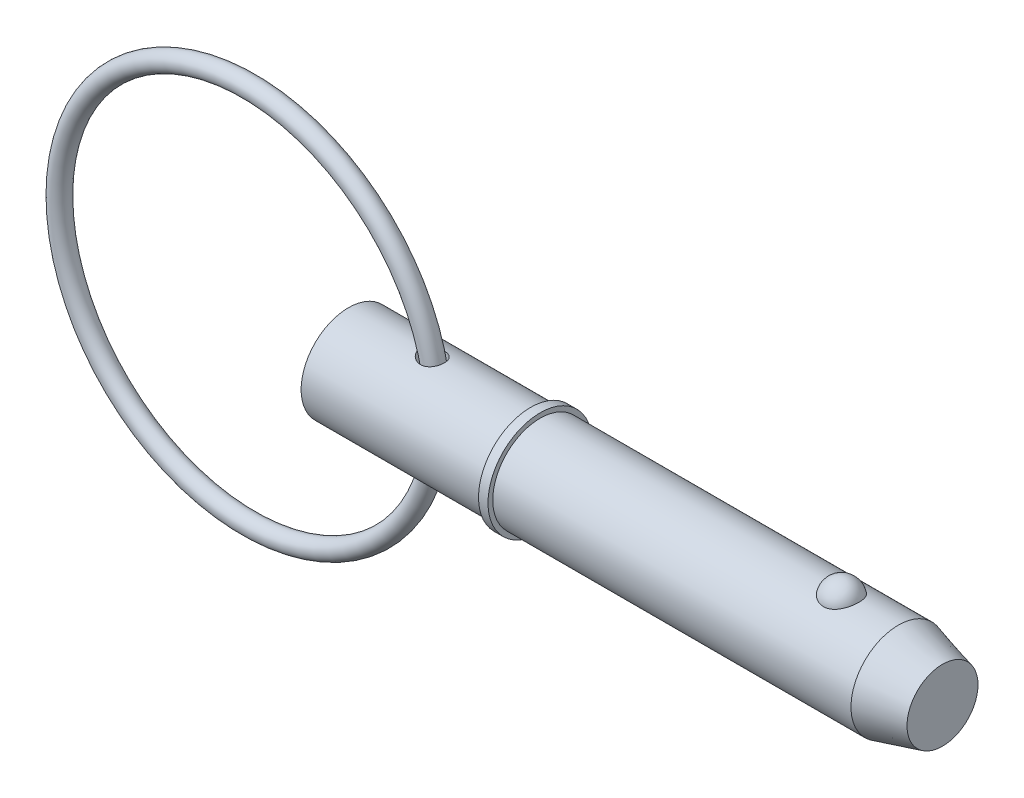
ISO-10303-21;
HEADER;
FILE_DESCRIPTION(('STEP AP214'),'2;1');
FILE_NAME('part.step','',(''),(''),'','','');
FILE_SCHEMA(('AUTOMOTIVE_DESIGN { 1 0 10303 214 1 1 1 1 }'));
ENDSEC;
DATA;
#1=APPLICATION_CONTEXT('core data for automotive mechanical design processes');
#2=APPLICATION_PROTOCOL_DEFINITION('international standard','automotive_design',2000,#1);
#3=PRODUCT_CONTEXT('',#1,'mechanical');
#4=PRODUCT('Part','Part','',(#3));
#5=PRODUCT_RELATED_PRODUCT_CATEGORY('part','',(#4));
#6=PRODUCT_DEFINITION_FORMATION('','',#4);
#7=PRODUCT_DEFINITION_CONTEXT('part definition',#1,'design');
#8=PRODUCT_DEFINITION('design','',#6,#7);
#9=PRODUCT_DEFINITION_SHAPE('','',#8);
#10=(LENGTH_UNIT() NAMED_UNIT(*) SI_UNIT(.MILLI.,.METRE.));
#11=(NAMED_UNIT(*) PLANE_ANGLE_UNIT() SI_UNIT($,.RADIAN.));
#12=(NAMED_UNIT(*) SI_UNIT($,.STERADIAN.) SOLID_ANGLE_UNIT());
#13=UNCERTAINTY_MEASURE_WITH_UNIT(LENGTH_MEASURE(1.E-05),#10,'distance_accuracy_value','');
#14=(GEOMETRIC_REPRESENTATION_CONTEXT(3) GLOBAL_UNCERTAINTY_ASSIGNED_CONTEXT((#13)) GLOBAL_UNIT_ASSIGNED_CONTEXT((#10,
#11,#12)) REPRESENTATION_CONTEXT('',''));
#15=CARTESIAN_POINT('',(0.,0.,0.));
#16=DIRECTION('',(0.,0.,1.));
#17=DIRECTION('',(1.,0.,0.));
#18=AXIS2_PLACEMENT_3D('',#15,#16,#17);
#19=CARTESIAN_POINT('',(-13.3798047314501,0.,0.));
#20=DIRECTION('',(0.,0.,1.));
#21=DIRECTION('',(1.,0.,0.));
#22=AXIS2_PLACEMENT_3D('',#19,#20,#21);
#23=TOROIDAL_SURFACE('',#22,25.4,1.27);
#24=CARTESIAN_POINT('',(13.2901952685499,0.,0.));
#25=VERTEX_POINT('',#24);
#26=VERTEX_LOOP('',#25);
#27=FACE_BOUND('',#26,.T.);
#28=ADVANCED_FACE('P0_F12',(#27),#23,.T.);
#29=CLOSED_SHELL('',(#28));
#30=MANIFOLD_SOLID_BREP('P0_B1',#29);
#31=CARTESIAN_POINT('',(0.,0.,0.));
#32=DIRECTION('',(1.,0.,0.));
#33=DIRECTION('',(0.,0.,-1.));
#34=AXIS2_PLACEMENT_3D('',#31,#32,#33);
#35=CYLINDRICAL_SURFACE('',#34,6.35);
#36=CARTESIAN_POINT('',(9.67500140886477,6.32698634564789,-0.540133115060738));
#37=CARTESIAN_POINT('',(9.70878953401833,6.3197498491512,-0.624879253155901));
#38=CARTESIAN_POINT('',(9.75028044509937,6.31105328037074,-0.706504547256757));
#39=CARTESIAN_POINT('',(9.84659255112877,6.29180070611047,-0.861319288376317));
#40=CARTESIAN_POINT('',(9.90144039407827,6.28124099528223,-0.934491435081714));
#41=CARTESIAN_POINT('',(10.021999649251,6.25949497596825,-1.0704877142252));
#42=CARTESIAN_POINT('',(10.0876589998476,6.2483118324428,-1.1333586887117));
#43=CARTESIAN_POINT('',(10.2280180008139,6.22641783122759,-1.24805262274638));
#44=CARTESIAN_POINT('',(10.3027159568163,6.21570688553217,-1.29987764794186));
#45=CARTESIAN_POINT('',(10.4650889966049,6.19509606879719,-1.39492899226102));
#46=CARTESIAN_POINT('',(10.5533142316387,6.1853135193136,-1.4372443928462));
#47=CARTESIAN_POINT('',(10.7357818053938,6.16871128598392,-1.50691441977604));
#48=CARTESIAN_POINT('',(10.8300253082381,6.16189217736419,-1.53426614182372));
#49=CARTESIAN_POINT('',(11.0227953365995,6.15211299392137,-1.57302798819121));
#50=CARTESIAN_POINT('',(11.1213511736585,6.14918579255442,-1.58430237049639));
#51=CARTESIAN_POINT('',(11.3189518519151,6.1478413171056,-1.58951619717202));
#52=CARTESIAN_POINT('',(11.417996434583,6.14942187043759,-1.58346399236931));
#53=CARTESIAN_POINT('',(11.6070859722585,6.15678569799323,-1.55457003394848));
#54=CARTESIAN_POINT('',(11.6973059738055,6.16229943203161,-1.53280404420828));
#55=CARTESIAN_POINT('',(11.8723373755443,6.176630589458,-1.4739892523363));
#56=CARTESIAN_POINT('',(11.9571502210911,6.185447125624,-1.43694455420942));
#57=CARTESIAN_POINT('',(12.1146737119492,6.20482821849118,-1.3507217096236));
#58=CARTESIAN_POINT('',(12.1877743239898,6.21528554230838,-1.30222952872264));
#59=CARTESIAN_POINT('',(12.324618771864,6.23705116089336,-1.19362916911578));
#60=CARTESIAN_POINT('',(12.3883628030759,6.24835943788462,-1.1335212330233));
#61=CARTESIAN_POINT('',(12.5046662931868,6.27053957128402,-1.00357204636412));
#62=CARTESIAN_POINT('',(12.5572571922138,6.28141258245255,-0.933759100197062));
#63=CARTESIAN_POINT('',(12.6502125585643,6.30157953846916,-0.786214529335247));
#64=CARTESIAN_POINT('',(12.6905764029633,6.31087340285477,-0.708482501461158));
#65=CARTESIAN_POINT('',(12.7585531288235,6.32699259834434,-0.546246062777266));
#66=CARTESIAN_POINT('',(12.7860022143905,6.33378599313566,-0.461669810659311));
#67=CARTESIAN_POINT('',(12.8267605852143,6.34401050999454,-0.288980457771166));
#68=CARTESIAN_POINT('',(12.8400695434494,6.34744155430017,-0.200867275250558));
#69=CARTESIAN_POINT('',(12.8522644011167,6.35058177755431,-0.0231943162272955));
#70=CARTESIAN_POINT('',(12.8510870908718,6.35027464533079,0.0663700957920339));
#71=CARTESIAN_POINT('',(12.8341831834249,6.34593169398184,0.244024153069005));
#72=CARTESIAN_POINT('',(12.8184563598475,6.341895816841,0.332113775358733));
#73=CARTESIAN_POINT('',(12.7728208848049,6.33052992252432,0.504322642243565));
#74=CARTESIAN_POINT('',(12.7429114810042,6.32319973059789,0.588441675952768));
#75=CARTESIAN_POINT('',(12.6696162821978,6.30604116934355,0.750316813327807));
#76=CARTESIAN_POINT('',(12.6262302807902,6.29621276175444,0.828072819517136));
#77=CARTESIAN_POINT('',(12.5270856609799,6.27515240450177,0.974918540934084));
#78=CARTESIAN_POINT('',(12.4713403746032,6.26392197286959,1.04401746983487));
#79=CARTESIAN_POINT('',(12.3488662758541,6.24131002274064,1.1716478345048));
#80=CARTESIAN_POINT('',(12.2821384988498,6.22992851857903,1.23018026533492));
#81=CARTESIAN_POINT('',(12.1401870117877,6.20841765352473,1.33449214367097));
#82=CARTESIAN_POINT('',(12.0650507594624,6.19827734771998,1.38038832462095));
#83=CARTESIAN_POINT('',(11.9079044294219,6.18026478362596,1.45892404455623));
#84=CARTESIAN_POINT('',(11.8258951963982,6.17239224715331,1.49156520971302));
#85=CARTESIAN_POINT('',(11.6581736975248,6.15982613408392,1.54263810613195));
#86=CARTESIAN_POINT('',(11.572502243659,6.15510409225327,1.56119728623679));
#87=CARTESIAN_POINT('',(11.3991899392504,6.14916283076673,1.58443707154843));
#88=CARTESIAN_POINT('',(11.3115488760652,6.14794399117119,1.58911617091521));
#89=CARTESIAN_POINT('',(11.1345547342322,6.14904466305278,1.58485137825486));
#90=CARTESIAN_POINT('',(11.0452104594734,6.15144894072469,1.5755811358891));
#91=CARTESIAN_POINT('',(10.8691479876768,6.15957601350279,1.54349959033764));
#92=CARTESIAN_POINT('',(10.782430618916,6.16529984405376,1.52068406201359));
#93=CARTESIAN_POINT('',(10.6082848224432,6.17983892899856,1.4605156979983));
#94=CARTESIAN_POINT('',(10.5211557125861,6.1888262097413,1.42233764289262));
#95=CARTESIAN_POINT('',(10.3542377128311,6.20874782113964,1.33268652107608));
#96=CARTESIAN_POINT('',(10.2744521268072,6.21968302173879,1.28120750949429));
#97=CARTESIAN_POINT('',(10.120854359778,6.24282707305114,1.16334748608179));
#98=CARTESIAN_POINT('',(10.0474902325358,6.25507146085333,1.09638652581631));
#99=CARTESIAN_POINT('',(9.91368693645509,6.27890019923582,0.950453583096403));
#100=CARTESIAN_POINT('',(9.85324511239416,6.29048468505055,0.87148407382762));
#101=CARTESIAN_POINT('',(9.75037543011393,6.31102161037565,0.707140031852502));
#102=CARTESIAN_POINT('',(9.70726585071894,6.32006820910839,0.622206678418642));
#103=CARTESIAN_POINT('',(9.63775895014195,6.33497125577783,0.445490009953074));
#104=CARTESIAN_POINT('',(9.61134627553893,6.34083063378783,0.35371307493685));
#105=CARTESIAN_POINT('',(9.57891955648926,6.34807071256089,0.177220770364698));
#106=CARTESIAN_POINT('',(9.5709352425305,6.3498832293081,0.0928817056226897));
#107=CARTESIAN_POINT('',(9.56994851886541,6.35010532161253,-0.0758268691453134));
#108=CARTESIAN_POINT('',(9.57692695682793,6.34851924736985,-0.160196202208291));
#109=CARTESIAN_POINT('',(9.59985709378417,6.34339435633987,-0.294043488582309));
#110=CARTESIAN_POINT('',(9.61128951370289,6.34084912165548,-0.34438537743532));
#111=CARTESIAN_POINT('',(9.63933183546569,6.33468615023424,-0.443526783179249));
#112=CARTESIAN_POINT('',(9.65594100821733,6.33106856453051,-0.492326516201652));
#113=CARTESIAN_POINT('',(9.67500140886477,6.32698634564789,-0.540133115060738));
#114=B_SPLINE_CURVE_WITH_KNOTS('',3,(#36,#37,#38,#39,#40,#41,#42,#43,#44,#45,#46,#47,#48,#49,
#50,#51,#52,#53,#54,#55,#56,#57,#58,#59,#60,#61,#62,#63,#64,#65,#66,#67,#68,#69,#70,#71,#72,#73,
#74,#75,#76,#77,#78,#79,#80,#81,#82,#83,#84,#85,#86,#87,#88,#89,#90,#91,#92,#93,#94,#95,#96,#97,
#98,#99,#100,#101,#102,#103,#104,#105,#106,#107,#108,#109,#110,#111,#112,#113),.UNSPECIFIED.,
.T.,.F.,(4,2,2,2,2,2,2,2,2,2,2,2,2,2,2,2,2,2,2,2,2,2,2,2,2,2,2,2,2,2,2,2,2,2,2,2,2,2,4),(0.,
0.274348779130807,0.54924945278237,0.822863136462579,1.09642560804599,1.3900770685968,
1.68378550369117,1.97995934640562,2.27599046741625,2.55347281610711,2.83088067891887,
3.09465189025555,3.35841759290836,3.62142956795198,3.88445494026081,4.1507318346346,
4.4170148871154,4.68446025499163,4.95190978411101,5.21937350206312,5.48684131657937,
5.75402200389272,6.02117751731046,6.28577524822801,6.55034050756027,6.81248178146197,
7.0746514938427,7.34305086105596,7.61153399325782,7.89692981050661,8.18245340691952,
8.48120635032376,8.77989784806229,9.06530254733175,9.35044442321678,9.60331609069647,
9.85586427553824,10.010650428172,10.1654147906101),.UNSPECIFIED.);
#115=CARTESIAN_POINT('',(9.67500140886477,6.32698634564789,-0.540133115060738));
#116=VERTEX_POINT('',#115);
#117=EDGE_CURVE('P1_E42',#116,#116,#114,.T.);
#118=ORIENTED_EDGE('',*,*,#117,.T.);
#119=EDGE_LOOP('',(#118));
#120=FACE_BOUND('',#119,.T.);
#121=CARTESIAN_POINT('',(0.,0.,0.));
#122=DIRECTION('',(1.,0.,0.));
#123=DIRECTION('',(0.,0.,-1.));
#124=AXIS2_PLACEMENT_3D('',#121,#122,#123);
#125=CIRCLE('',#124,6.35);
#126=CARTESIAN_POINT('',(0.,0.,-6.35));
#127=VERTEX_POINT('',#126);
#128=EDGE_CURVE('P1_E9',#127,#127,#125,.T.);
#129=ORIENTED_EDGE('',*,*,#128,.T.);
#130=EDGE_LOOP('',(#129));
#131=FACE_BOUND('',#130,.T.);
#132=CARTESIAN_POINT('',(24.43,0.,0.));
#133=DIRECTION('',(1.,0.,0.));
#134=DIRECTION('',(0.,0.,-1.));
#135=AXIS2_PLACEMENT_3D('',#132,#133,#134);
#136=CIRCLE('',#135,6.35);
#137=CARTESIAN_POINT('',(24.43,0.,-6.35));
#138=VERTEX_POINT('',#137);
#139=EDGE_CURVE('P1_E25',#138,#138,#136,.T.);
#140=ORIENTED_EDGE('',*,*,#139,.F.);
#141=EDGE_LOOP('',(#140));
#142=FACE_BOUND('',#141,.T.);
#143=CARTESIAN_POINT('',(9.67500140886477,-6.32698634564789,-0.540133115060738));
#144=CARTESIAN_POINT('',(9.64544894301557,-6.33331515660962,-0.46600258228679));
#145=CARTESIAN_POINT('',(9.62177180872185,-6.33852974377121,-0.389437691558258));
#146=CARTESIAN_POINT('',(9.58727043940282,-6.34619174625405,-0.233330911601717));
#147=CARTESIAN_POINT('',(9.57644043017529,-6.34864040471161,-0.153790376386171));
#148=CARTESIAN_POINT('',(9.56819517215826,-6.3505010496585,0.00612071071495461));
#149=CARTESIAN_POINT('',(9.57079639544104,-6.34990930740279,0.0864921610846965));
#150=CARTESIAN_POINT('',(9.58930797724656,-6.3457478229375,0.245607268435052));
#151=CARTESIAN_POINT('',(9.60522046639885,-6.34217760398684,0.324350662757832));
#152=CARTESIAN_POINT('',(9.64931570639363,-6.3324977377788,0.47727605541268));
#153=CARTESIAN_POINT('',(9.67737525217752,-6.32641361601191,0.551495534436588));
#154=CARTESIAN_POINT('',(9.74451510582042,-6.31231128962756,0.69455132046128));
#155=CARTESIAN_POINT('',(9.78359827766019,-6.30429258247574,0.763386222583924));
#156=CARTESIAN_POINT('',(9.87474700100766,-6.28638332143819,0.899414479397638));
#157=CARTESIAN_POINT('',(9.92757481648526,-6.27639669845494,0.966083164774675));
#158=CARTESIAN_POINT('',(10.042675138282,-6.25596164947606,1.09061181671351));
#159=CARTESIAN_POINT('',(10.1049521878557,-6.24551300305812,1.14846751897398));
#160=CARTESIAN_POINT('',(10.2445505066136,-6.22397505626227,1.26024641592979));
#161=CARTESIAN_POINT('',(10.3227711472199,-6.2129394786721,1.31305951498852));
#162=CARTESIAN_POINT('',(10.4867924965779,-6.19263757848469,1.40570084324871));
#163=CARTESIAN_POINT('',(10.5725962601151,-6.18337197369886,1.44552380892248));
#164=CARTESIAN_POINT('',(10.7543302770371,-6.16725983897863,1.51283687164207));
#165=CARTESIAN_POINT('',(10.8505554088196,-6.16056505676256,1.53957358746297));
#166=CARTESIAN_POINT('',(11.0463546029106,-6.15127671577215,1.57628137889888));
#167=CARTESIAN_POINT('',(11.1459276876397,-6.14868197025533,1.58625730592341));
#168=CARTESIAN_POINT('',(11.3414257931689,-6.14810798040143,1.58848000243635));
#169=CARTESIAN_POINT('',(11.4373417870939,-6.14995283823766,1.58140242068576));
#170=CARTESIAN_POINT('',(11.6262783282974,-6.1577972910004,1.55057566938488));
#171=CARTESIAN_POINT('',(11.719300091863,-6.16379511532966,1.52683360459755));
#172=CARTESIAN_POINT('',(11.8934223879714,-6.17873566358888,1.46514575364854));
#173=CARTESIAN_POINT('',(11.9749048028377,-6.18746207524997,1.42822144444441));
#174=CARTESIAN_POINT('',(12.1301362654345,-6.20693584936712,1.34105645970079));
#175=CARTESIAN_POINT('',(12.2038861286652,-6.21768299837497,1.29081719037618));
#176=CARTESIAN_POINT('',(12.3399792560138,-6.23970077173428,1.17972764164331));
#177=CARTESIAN_POINT('',(12.4025430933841,-6.25095401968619,1.11914355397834));
#178=CARTESIAN_POINT('',(12.5166805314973,-6.27296916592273,0.988307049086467));
#179=CARTESIAN_POINT('',(12.568253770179,-6.28373104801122,0.918054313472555));
#180=CARTESIAN_POINT('',(12.6596230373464,-6.3037060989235,0.769081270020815));
#181=CARTESIAN_POINT('',(12.6992956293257,-6.31290263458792,0.690283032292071));
#182=CARTESIAN_POINT('',(12.7652258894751,-6.32862394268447,0.527011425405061));
#183=CARTESIAN_POINT('',(12.7914829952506,-6.33514860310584,0.442537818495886));
#184=CARTESIAN_POINT('',(12.8301436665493,-6.34487485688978,0.269505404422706));
#185=CARTESIAN_POINT('',(12.8424230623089,-6.34804664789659,0.180917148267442));
#186=CARTESIAN_POINT('',(12.8524214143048,-6.35062347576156,0.00286829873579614));
#187=CARTESIAN_POINT('',(12.8501402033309,-6.35002846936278,-0.0865923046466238));
#188=CARTESIAN_POINT('',(12.8310619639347,-6.34513332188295,-0.263931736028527));
#189=CARTESIAN_POINT('',(12.8142517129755,-6.34082980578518,-0.35180904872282));
#190=CARTESIAN_POINT('',(12.7664911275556,-6.32897674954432,-0.523406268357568));
#191=CARTESIAN_POINT('',(12.7355404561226,-6.3214271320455,-0.607126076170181));
#192=CARTESIAN_POINT('',(12.6602298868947,-6.30390232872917,-0.768030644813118));
#193=CARTESIAN_POINT('',(12.6158695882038,-6.29392707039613,-0.845215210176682));
#194=CARTESIAN_POINT('',(12.5148171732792,-6.2726521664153,-0.990836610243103));
#195=CARTESIAN_POINT('',(12.4581254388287,-6.26135256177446,-1.05927371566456));
#196=CARTESIAN_POINT('',(12.33416419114,-6.2387572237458,-1.18510935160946));
#197=CARTESIAN_POINT('',(12.2669484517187,-6.22746174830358,-1.24256086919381));
#198=CARTESIAN_POINT('',(12.1235592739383,-6.20610255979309,-1.34519464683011));
#199=CARTESIAN_POINT('',(12.0473871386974,-6.19603866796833,-1.39037868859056));
#200=CARTESIAN_POINT('',(11.8892714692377,-6.17839642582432,-1.46678006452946));
#201=CARTESIAN_POINT('',(11.8074126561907,-6.17078838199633,-1.49816605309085));
#202=CARTESIAN_POINT('',(11.6394563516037,-6.15869606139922,-1.54712759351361));
#203=CARTESIAN_POINT('',(11.5533589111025,-6.15421174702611,-1.56470331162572));
#204=CARTESIAN_POINT('',(11.3789660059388,-6.14876652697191,-1.58596734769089));
#205=CARTESIAN_POINT('',(11.2906621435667,-6.1478222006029,-1.58959032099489));
#206=CARTESIAN_POINT('',(11.1146029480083,-6.149490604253,-1.58312110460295));
#207=CARTESIAN_POINT('',(11.0268477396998,-6.1521041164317,-1.57302589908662));
#208=CARTESIAN_POINT('',(10.8498668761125,-6.16071031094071,-1.53898332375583));
#209=CARTESIAN_POINT('',(10.7607726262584,-6.16685908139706,-1.51439468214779));
#210=CARTESIAN_POINT('',(10.5876521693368,-6.18189031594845,-1.45181305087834));
#211=CARTESIAN_POINT('',(10.5036282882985,-6.19077402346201,-1.41381396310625));
#212=CARTESIAN_POINT('',(10.3374228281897,-6.2109378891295,-1.32252480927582));
#213=CARTESIAN_POINT('',(10.255708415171,-6.2223355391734,-1.26840756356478));
#214=CARTESIAN_POINT('',(10.1025645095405,-6.24580740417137,-1.14725208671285));
#215=CARTESIAN_POINT('',(10.0311354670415,-6.25788164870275,-1.08021329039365));
#216=CARTESIAN_POINT('',(9.90472699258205,-6.2806176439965,-0.938710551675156));
#217=CARTESIAN_POINT('',(9.84904456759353,-6.29132066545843,-0.864883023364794));
#218=CARTESIAN_POINT('',(9.75129345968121,-6.31084098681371,-0.708496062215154));
#219=CARTESIAN_POINT('',(9.70921094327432,-6.31966019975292,-0.625945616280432));
#220=CARTESIAN_POINT('',(9.67500140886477,-6.32698634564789,-0.540133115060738));
#221=B_SPLINE_CURVE_WITH_KNOTS('',3,(#143,#144,#145,#146,#147,#148,#149,#150,#151,#152,#153,
#154,#155,#156,#157,#158,#159,#160,#161,#162,#163,#164,#165,#166,#167,#168,#169,#170,#171,#172,
#173,#174,#175,#176,#177,#178,#179,#180,#181,#182,#183,#184,#185,#186,#187,#188,#189,#190,#191,
#192,#193,#194,#195,#196,#197,#198,#199,#200,#201,#202,#203,#204,#205,#206,#207,#208,#209,#210,
#211,#212,#213,#214,#215,#216,#217,#218,#219,#220),.UNSPECIFIED.,.T.,.F.,(4,2,2,2,2,2,2,2,2,2,2,
2,2,2,2,2,2,2,2,2,2,2,2,2,2,2,2,2,2,2,2,2,2,2,2,2,2,2,4),(0.,0.239871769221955,
0.479635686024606,0.719693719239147,0.959790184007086,1.19750645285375,1.43528453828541,
1.69117930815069,1.94719750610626,2.23102979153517,2.51497694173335,2.81376497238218,
3.11246650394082,3.39952951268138,3.68647020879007,3.95479420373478,4.22308987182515,
4.48530700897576,4.74753278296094,5.01239119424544,5.27726070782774,5.54446524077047,
5.81167284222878,6.07912387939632,6.34658129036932,6.61404669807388,6.88150382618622,
7.1476364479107,7.41373039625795,7.67647472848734,7.93921589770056,8.20318607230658,
8.46721428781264,8.74390821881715,9.02072813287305,9.31537622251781,9.61003720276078,
9.88799314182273,10.1656654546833),.UNSPECIFIED.);
#222=CARTESIAN_POINT('',(9.67500140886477,-6.32698634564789,-0.540133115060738));
#223=VERTEX_POINT('',#222);
#224=EDGE_CURVE('P1_E17',#223,#223,#221,.T.);
#225=ORIENTED_EDGE('',*,*,#224,.T.);
#226=EDGE_LOOP('',(#225));
#227=FACE_BOUND('',#226,.T.);
#228=ADVANCED_FACE('P1_F13',(#120,#131,#142,#227),#35,.T.);
#229=CARTESIAN_POINT('',(0.,0.,0.));
#230=DIRECTION('',(1.,0.,0.));
#231=DIRECTION('',(0.,0.,-1.));
#232=AXIS2_PLACEMENT_3D('',#229,#230,#231);
#233=CYLINDRICAL_SURFACE('',#232,6.35);
#234=CARTESIAN_POINT('',(73.7553693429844,0.,0.));
#235=DIRECTION('',(1.,0.,0.));
#236=DIRECTION('',(0.,0.,-1.));
#237=AXIS2_PLACEMENT_3D('',#234,#235,#236);
#238=CIRCLE('',#237,6.35);
#239=CARTESIAN_POINT('',(73.7553693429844,0.,-6.35));
#240=VERTEX_POINT('',#239);
#241=EDGE_CURVE('P1_E99',#240,#240,#238,.T.);
#242=ORIENTED_EDGE('',*,*,#241,.F.);
#243=EDGE_LOOP('',(#242));
#244=FACE_BOUND('',#243,.T.);
#245=CARTESIAN_POINT('',(25.7,0.,0.));
#246=DIRECTION('',(1.,0.,0.));
#247=DIRECTION('',(0.,0.,-1.));
#248=AXIS2_PLACEMENT_3D('',#245,#246,#247);
#249=CIRCLE('',#248,6.35);
#250=CARTESIAN_POINT('',(25.7,0.,-6.35));
#251=VERTEX_POINT('',#250);
#252=EDGE_CURVE('P1_E96',#251,#251,#249,.T.);
#253=ORIENTED_EDGE('',*,*,#252,.T.);
#254=EDGE_LOOP('',(#253));
#255=FACE_BOUND('',#254,.T.);
#256=CARTESIAN_POINT('',(66.1300214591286,5.87502187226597,2.40969251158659));
#257=CARTESIAN_POINT('',(66.0050305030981,5.87501645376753,2.40969773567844));
#258=CARTESIAN_POINT('',(65.8800806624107,5.87916061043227,2.39967292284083));
#259=CARTESIAN_POINT('',(65.6339091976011,5.8952311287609,2.35991730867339));
#260=CARTESIAN_POINT('',(65.5126863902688,5.90715499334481,2.33019283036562));
#261=CARTESIAN_POINT('',(65.2775170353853,5.93739567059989,2.25201402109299));
#262=CARTESIAN_POINT('',(65.1635602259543,5.95570321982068,2.20358681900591));
#263=CARTESIAN_POINT('',(64.94557352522,5.99672067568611,2.08937987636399));
#264=CARTESIAN_POINT('',(64.8415457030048,6.01943149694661,2.02359652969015));
#265=CARTESIAN_POINT('',(64.6429437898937,6.06760647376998,1.87428969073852));
#266=CARTESIAN_POINT('',(64.5487268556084,6.09313095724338,1.79031110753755));
#267=CARTESIAN_POINT('',(64.3752557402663,6.14375873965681,1.60800178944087));
#268=CARTESIAN_POINT('',(64.2960043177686,6.16886196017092,1.50966841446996));
#269=CARTESIAN_POINT('',(64.1508457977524,6.21724600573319,1.29645884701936));
#270=CARTESIAN_POINT('',(64.0856885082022,6.24039621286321,1.1810415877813));
#271=CARTESIAN_POINT('',(63.9747035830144,6.28117277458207,0.94035184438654));
#272=CARTESIAN_POINT('',(63.9288776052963,6.29879865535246,0.815078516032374));
#273=CARTESIAN_POINT('',(63.8570234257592,6.32692073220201,0.556494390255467));
#274=CARTESIAN_POINT('',(63.831249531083,6.33732517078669,0.423102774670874));
#275=CARTESIAN_POINT('',(63.8009885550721,6.34957673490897,0.153542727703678));
#276=CARTESIAN_POINT('',(63.7965009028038,6.35142408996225,0.0173743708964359));
#277=CARTESIAN_POINT('',(63.8088655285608,6.34638925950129,-0.253036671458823));
#278=CARTESIAN_POINT('',(63.8255949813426,6.33955731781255,-0.38728593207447));
#279=CARTESIAN_POINT('',(63.879843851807,6.31794129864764,-0.650851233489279));
#280=CARTESIAN_POINT('',(63.9173636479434,6.30315707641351,-0.780167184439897));
#281=CARTESIAN_POINT('',(64.012500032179,6.26711642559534,-1.03041949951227));
#282=CARTESIAN_POINT('',(64.070143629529,6.24585130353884,-1.1513443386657));
#283=CARTESIAN_POINT('',(64.2043522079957,6.19905619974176,-1.38129800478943));
#284=CARTESIAN_POINT('',(64.280918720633,6.17352587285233,-1.49032586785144));
#285=CARTESIAN_POINT('',(64.4517538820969,6.12080227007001,-1.69393164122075));
#286=CARTESIAN_POINT('',(64.5461008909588,6.09360200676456,-1.78844209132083));
#287=CARTESIAN_POINT('',(64.7501196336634,6.04070434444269,-1.95970536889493));
#288=CARTESIAN_POINT('',(64.8597900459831,6.01500681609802,-2.03645972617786));
#289=CARTESIAN_POINT('',(65.0891876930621,5.96867714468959,-2.1684564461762));
#290=CARTESIAN_POINT('',(65.2086522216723,5.94794910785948,-2.22412062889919));
#291=CARTESIAN_POINT('',(65.4562188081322,5.91340580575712,-2.31440992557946));
#292=CARTESIAN_POINT('',(65.5843175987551,5.8995879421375,-2.3490429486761));
#293=CARTESIAN_POINT('',(65.8385820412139,5.88111049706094,-2.39491590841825));
#294=CARTESIAN_POINT('',(65.9645207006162,5.876025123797,-2.40724512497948));
#295=CARTESIAN_POINT('',(66.2167867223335,5.87428980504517,-2.41147867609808));
#296=CARTESIAN_POINT('',(66.343114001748,5.87763817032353,-2.40338710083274));
#297=CARTESIAN_POINT('',(66.5884170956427,5.89212921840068,-2.36762715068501));
#298=CARTESIAN_POINT('',(66.7074992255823,5.90302431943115,-2.34058030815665));
#299=CARTESIAN_POINT('',(66.9392447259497,5.93113752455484,-2.26839066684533));
#300=CARTESIAN_POINT('',(67.0519075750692,5.94835614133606,-2.2232464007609));
#301=CARTESIAN_POINT('',(67.2704009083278,5.98773016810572,-2.11493806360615));
#302=CARTESIAN_POINT('',(67.376028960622,6.00998499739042,-2.05140269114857));
#303=CARTESIAN_POINT('',(67.5753006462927,6.05690144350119,-1.90842705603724));
#304=CARTESIAN_POINT('',(67.6689415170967,6.08156361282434,-1.82898313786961));
#305=CARTESIAN_POINT('',(67.8466754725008,6.13211715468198,-1.65182429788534));
#306=CARTESIAN_POINT('',(67.930055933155,6.15800825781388,-1.55339381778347));
#307=CARTESIAN_POINT('',(68.0797900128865,6.20712834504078,-1.34374214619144));
#308=CARTESIAN_POINT('',(68.1461405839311,6.23035685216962,-1.23251867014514));
#309=CARTESIAN_POINT('',(68.2623455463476,6.27251177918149,-0.996447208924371));
#310=CARTESIAN_POINT('',(68.3116072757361,6.29127762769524,-0.871278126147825));
#311=CARTESIAN_POINT('',(68.3896142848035,6.3215862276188,-0.613870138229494));
#312=CARTESIAN_POINT('',(68.4183593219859,6.33312889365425,-0.481631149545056));
#313=CARTESIAN_POINT('',(68.4547705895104,6.34782349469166,-0.213672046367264));
#314=CARTESIAN_POINT('',(68.4624134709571,6.35096613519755,-0.0779482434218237));
#315=CARTESIAN_POINT('',(68.4563951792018,6.34851322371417,0.192943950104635));
#316=CARTESIAN_POINT('',(68.4427343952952,6.3429178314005,0.328112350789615));
#317=CARTESIAN_POINT('',(68.3945036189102,6.32360512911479,0.593406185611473));
#318=CARTESIAN_POINT('',(68.3600313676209,6.30992579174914,0.723552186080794));
#319=CARTESIAN_POINT('',(68.2709539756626,6.27586325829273,0.975834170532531));
#320=CARTESIAN_POINT('',(68.2163476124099,6.25547965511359,1.09796966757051));
#321=CARTESIAN_POINT('',(68.0877587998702,6.20998183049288,1.33148921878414));
#322=CARTESIAN_POINT('',(68.0136742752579,6.18484288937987,1.44281227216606));
#323=CARTESIAN_POINT('',(67.8478204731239,6.13258735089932,1.65087683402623));
#324=CARTESIAN_POINT('',(67.7560515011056,6.10547078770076,1.74761859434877));
#325=CARTESIAN_POINT('',(67.5571839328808,6.05235879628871,1.92350926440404));
#326=CARTESIAN_POINT('',(67.450133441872,6.0263601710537,2.00271146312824));
#327=CARTESIAN_POINT('',(67.2231384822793,5.97843747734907,2.1415415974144));
#328=CARTESIAN_POINT('',(67.103191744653,5.95651412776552,2.20116608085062));
#329=CARTESIAN_POINT('',(66.8445236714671,5.91812106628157,2.30250570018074));
#330=CARTESIAN_POINT('',(66.7050698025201,5.90217533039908,2.34256795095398));
#331=CARTESIAN_POINT('',(66.4203974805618,5.88063128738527,2.39615214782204));
#332=CARTESIAN_POINT('',(66.2751817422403,5.8750281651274,2.40968644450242));
#333=CARTESIAN_POINT('',(66.1300214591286,5.87502187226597,2.40969251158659));
#334=B_SPLINE_CURVE_WITH_KNOTS('',3,(#256,#257,#258,#259,#260,#261,#262,#263,#264,#265,#266,
#267,#268,#269,#270,#271,#272,#273,#274,#275,#276,#277,#278,#279,#280,#281,#282,#283,#284,#285,
#286,#287,#288,#289,#290,#291,#292,#293,#294,#295,#296,#297,#298,#299,#300,#301,#302,#303,#304,
#305,#306,#307,#308,#309,#310,#311,#312,#313,#314,#315,#316,#317,#318,#319,#320,#321,#322,#323,
#324,#325,#326,#327,#328,#329,#330,#331,#332,#333),.UNSPECIFIED.,.T.,.F.,(4,2,2,2,2,2,2,2,2,2,2,
2,2,2,2,2,2,2,2,2,2,2,2,2,2,2,2,2,2,2,2,2,2,2,2,2,2,2,4),(0.,0.374440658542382,
0.748761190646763,1.12254078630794,1.49639810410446,1.88098871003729,2.26565013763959,
2.66741104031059,3.06920639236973,3.47601794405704,3.88281858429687,4.28727498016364,
4.69173873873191,5.09674745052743,5.50178895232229,5.9086591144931,6.31549420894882,
6.71369855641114,7.1117530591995,7.48978077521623,7.86773278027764,8.23383886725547,
8.59997464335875,8.97409044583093,9.34829231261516,9.7412266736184,10.1342313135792,
10.5397522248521,10.9452779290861,11.3512521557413,11.7572189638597,12.1612938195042,
12.5653932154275,12.9716540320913,13.3779078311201,13.7829098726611,14.1879832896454,
14.6230486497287,15.0579114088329),.UNSPECIFIED.);
#335=CARTESIAN_POINT('',(66.1300214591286,5.87502187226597,2.40969251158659));
#336=VERTEX_POINT('',#335);
#337=EDGE_CURVE('P1_E34',#336,#336,#334,.T.);
#338=ORIENTED_EDGE('',*,*,#337,.T.);
#339=EDGE_LOOP('',(#338));
#340=FACE_BOUND('',#339,.T.);
#341=ADVANCED_FACE('P1_F46',(#244,#255,#340),#233,.T.);
#342=CARTESIAN_POINT('',(0.,0.,0.));
#343=DIRECTION('',(-1.,0.,0.));
#344=DIRECTION('',(0.,0.,1.));
#345=AXIS2_PLACEMENT_3D('',#342,#343,#344);
#346=PLANE('',#345);
#347=ORIENTED_EDGE('',*,*,#128,.F.);
#348=EDGE_LOOP('',(#347));
#349=FACE_BOUND('',#348,.T.);
#350=ADVANCED_FACE('P1_F15',(#349),#346,.T.);
#351=CARTESIAN_POINT('',(24.43,6.35,0.));
#352=DIRECTION('',(-1.,0.,0.));
#353=DIRECTION('',(0.,0.,1.));
#354=AXIS2_PLACEMENT_3D('',#351,#352,#353);
#355=PLANE('',#354);
#356=ORIENTED_EDGE('',*,*,#139,.T.);
#357=EDGE_LOOP('',(#356));
#358=FACE_BOUND('',#357,.T.);
#359=CARTESIAN_POINT('',(24.43,0.,0.));
#360=DIRECTION('',(1.,0.,0.));
#361=DIRECTION('',(0.,0.,-1.));
#362=AXIS2_PLACEMENT_3D('',#359,#360,#361);
#363=CIRCLE('',#362,6.985);
#364=CARTESIAN_POINT('',(24.43,0.,-6.985));
#365=VERTEX_POINT('',#364);
#366=EDGE_CURVE('P1_E30',#365,#365,#363,.T.);
#367=ORIENTED_EDGE('',*,*,#366,.F.);
#368=EDGE_LOOP('',(#367));
#369=FACE_BOUND('',#368,.T.);
#370=ADVANCED_FACE('P1_F81',(#358,#369),#355,.T.);
#371=CARTESIAN_POINT('',(0.,0.,0.));
#372=DIRECTION('',(1.,0.,0.));
#373=DIRECTION('',(0.,0.,-1.));
#374=AXIS2_PLACEMENT_3D('',#371,#372,#373);
#375=CYLINDRICAL_SURFACE('',#374,6.985);
#376=ORIENTED_EDGE('',*,*,#366,.T.);
#377=EDGE_LOOP('',(#376));
#378=FACE_BOUND('',#377,.T.);
#379=CARTESIAN_POINT('',(25.7,0.,0.));
#380=DIRECTION('',(1.,0.,0.));
#381=DIRECTION('',(0.,0.,-1.));
#382=AXIS2_PLACEMENT_3D('',#379,#380,#381);
#383=CIRCLE('',#382,6.985);
#384=CARTESIAN_POINT('',(25.7,0.,-6.985));
#385=VERTEX_POINT('',#384);
#386=EDGE_CURVE('P1_E95',#385,#385,#383,.T.);
#387=ORIENTED_EDGE('',*,*,#386,.F.);
#388=EDGE_LOOP('',(#387));
#389=FACE_BOUND('',#388,.T.);
#390=ADVANCED_FACE('P1_F68',(#378,#389),#375,.T.);
#391=CARTESIAN_POINT('',(25.7,6.985,0.));
#392=DIRECTION('',(1.,0.,0.));
#393=DIRECTION('',(0.,0.,-1.));
#394=AXIS2_PLACEMENT_3D('',#391,#392,#393);
#395=PLANE('',#394);
#396=ORIENTED_EDGE('',*,*,#386,.T.);
#397=EDGE_LOOP('',(#396));
#398=FACE_BOUND('',#397,.T.);
#399=ORIENTED_EDGE('',*,*,#252,.F.);
#400=EDGE_LOOP('',(#399));
#401=FACE_BOUND('',#400,.T.);
#402=ADVANCED_FACE('P1_F62',(#398,#401),#395,.T.);
#403=CARTESIAN_POINT('',(79.68,0.,0.));
#404=DIRECTION('',(-1.,0.,0.));
#405=DIRECTION('',(0.,0.,1.));
#406=AXIS2_PLACEMENT_3D('',#403,#404,#405);
#407=CONICAL_SURFACE('',#406,4.76250000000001,0.26179938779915);
#408=ORIENTED_EDGE('',*,*,#241,.T.);
#409=EDGE_LOOP('',(#408));
#410=FACE_BOUND('',#409,.T.);
#411=CARTESIAN_POINT('',(79.68,0.,0.));
#412=DIRECTION('',(1.,0.,0.));
#413=DIRECTION('',(0.,0.,-1.));
#414=AXIS2_PLACEMENT_3D('',#411,#412,#413);
#415=CIRCLE('',#414,4.76250000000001);
#416=CARTESIAN_POINT('',(79.68,0.,-4.76250000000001));
#417=VERTEX_POINT('',#416);
#418=EDGE_CURVE('P1_E41',#417,#417,#415,.T.);
#419=ORIENTED_EDGE('',*,*,#418,.F.);
#420=EDGE_LOOP('',(#419));
#421=FACE_BOUND('',#420,.T.);
#422=ADVANCED_FACE('P1_F59',(#410,#421),#407,.T.);
#423=CARTESIAN_POINT('',(79.68,4.76250000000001,0.));
#424=DIRECTION('',(1.,0.,0.));
#425=DIRECTION('',(0.,0.,-1.));
#426=AXIS2_PLACEMENT_3D('',#423,#424,#425);
#427=PLANE('',#426);
#428=ORIENTED_EDGE('',*,*,#418,.T.);
#429=EDGE_LOOP('',(#428));
#430=FACE_BOUND('',#429,.T.);
#431=ADVANCED_FACE('P1_F55',(#430),#427,.T.);
#432=CARTESIAN_POINT('',(66.1300214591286,5.71499999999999,0.));
#433=DIRECTION('',(-1.,0.,0.));
#434=DIRECTION('',(0.,1.,0.));
#435=AXIS2_PLACEMENT_3D('',#432,#433,#434);
#436=SPHERICAL_SURFACE('',#435,2.415);
#437=ORIENTED_EDGE('',*,*,#337,.F.);
#438=EDGE_LOOP('',(#437));
#439=FACE_BOUND('',#438,.T.);
#440=ADVANCED_FACE('P1_F50',(#439),#436,.T.);
#441=CARTESIAN_POINT('',(-13.3798047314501,0.,0.));
#442=DIRECTION('',(0.,0.,1.));
#443=DIRECTION('',(1.,0.,0.));
#444=AXIS2_PLACEMENT_3D('',#441,#442,#443);
#445=TOROIDAL_SURFACE('',#444,25.4,1.5875);
#446=ORIENTED_EDGE('',*,*,#224,.F.);
#447=EDGE_LOOP('',(#446));
#448=FACE_BOUND('',#447,.T.);
#449=ORIENTED_EDGE('',*,*,#117,.F.);
#450=EDGE_LOOP('',(#449));
#451=FACE_BOUND('',#450,.T.);
#452=ADVANCED_FACE('P1_F54',(#448,#451),#445,.F.);
#453=CLOSED_SHELL('',(#228,#341,#350,#370,#390,#402,#422,#431,#440,#452));
#454=MANIFOLD_SOLID_BREP('P1_B1',#453);
#455=ADVANCED_BREP_SHAPE_REPRESENTATION('',(#18,#30,#454),#14);
#456=SHAPE_DEFINITION_REPRESENTATION(#9,#455);
ENDSEC;
END-ISO-10303-21;
